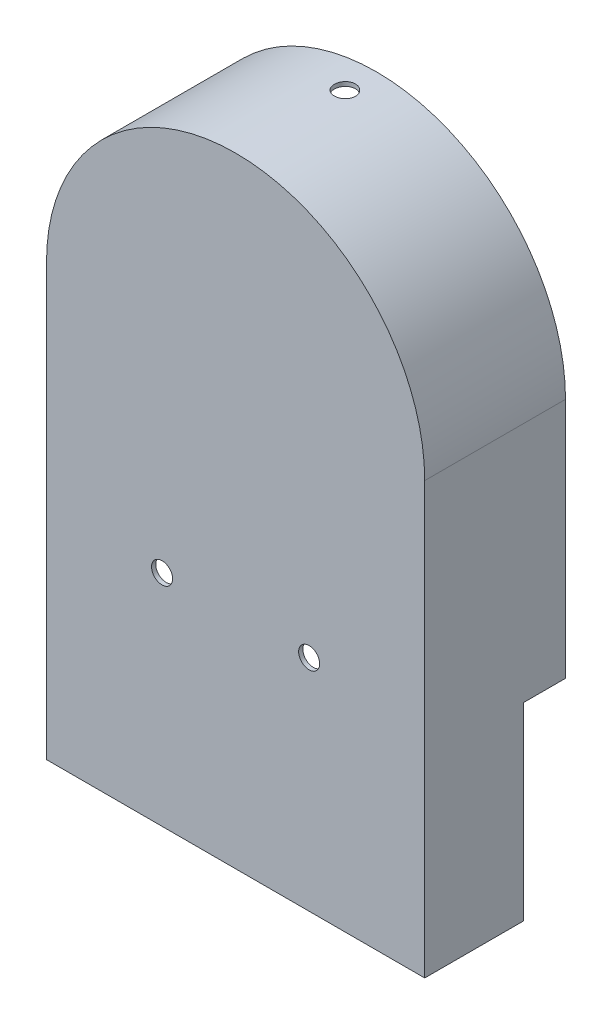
from build123d import *

# Parameters (mm, degrees)
EXTRUSION1_DEPTH        = 2
EXTRUSION2_START        = 65
EXTRUSION2_DEPTH        = 65
ESQUISSE3_W             = 20
ESQUISSE3_H             = 90
ENL_V_MAT_EXTRU_1_DEPTH = 281.446073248
ESQUISSE4_R             = 5
ENL_V_MAT_EXTRU_2_DEPTH = 234.696384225
ESQUISSE5_R             = 5
ENL_V_MAT_EXTRU_4_DEPTH = 234.130864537


with BuildPart() as part:
    # Esquisse1 → Extrusion1 (new body)
    with BuildSketch(Plane.XY):
        with BuildLine():
            Line((90, 0), (90, -205))
            Line((90, -205), (-90, -205))
            Line((-90, -205), (-90, 0))
            ThreePointArc((-90, 0), (0, 90), (90, 0))
        make_face()
    extrude(amount=EXTRUSION1_DEPTH)

    # Esquisse2 → Extrusion2 (add)
    with BuildSketch(Plane(origin=(0, 0, 0), x_dir=(-1, 0, 0), z_dir=(0, 0, -1)).offset(EXTRUSION2_START)):
        with BuildLine():
            Line((90, -205), (90, 0))
            ThreePointArc((90, 0), (0, 90), (-90, 0))
            Line((-90, 0), (-90, -205))
            Line((-90, -205), (90, -205))
        make_face()
        with BuildLine():
            Line((88, -203), (88, 0))
            ThreePointArc((88, 0), (0, 88), (-88, 0))
            Line((-88, 0), (-88, -203))
            Line((-88, -203), (88, -203))
        make_face(mode=Mode.SUBTRACT)
    extrude(amount=-EXTRUSION2_DEPTH)

    # Esquisse3 → Enl_v. mat.-Extru.1 (cut, through all)
    with BuildSketch(Plane.ZY.offset(90)):
        with Locations((-55, -160)):
            Rectangle(ESQUISSE3_W, ESQUISSE3_H)
    extrude(amount=-ENL_V_MAT_EXTRU_1_DEPTH, mode=Mode.SUBTRACT)

    # Esquisse4 → Enl_v. mat.-Extru.2 (cut, through all)
    with BuildSketch(Plane.XY.offset(2)):
        with Locations((35, -100.5)):
            Circle(ESQUISSE4_R)
        with Locations((-35, -100.5)):
            Circle(ESQUISSE4_R)
    extrude(amount=-ENL_V_MAT_EXTRU_2_DEPTH, mode=Mode.SUBTRACT)

    # Esquisse5 → Enl_v. mat.-Extru.4 (cut, through all)
    with BuildSketch(Plane(origin=(0, 0, 0), x_dir=(1, 0, 0), z_dir=(0, 1, 0))):
        with Locations(Location((0, 50, 0), (0, 0, 90))):
            Circle(ESQUISSE5_R)
    extrude(amount=ENL_V_MAT_EXTRU_4_DEPTH, mode=Mode.SUBTRACT)


solid = part.part
